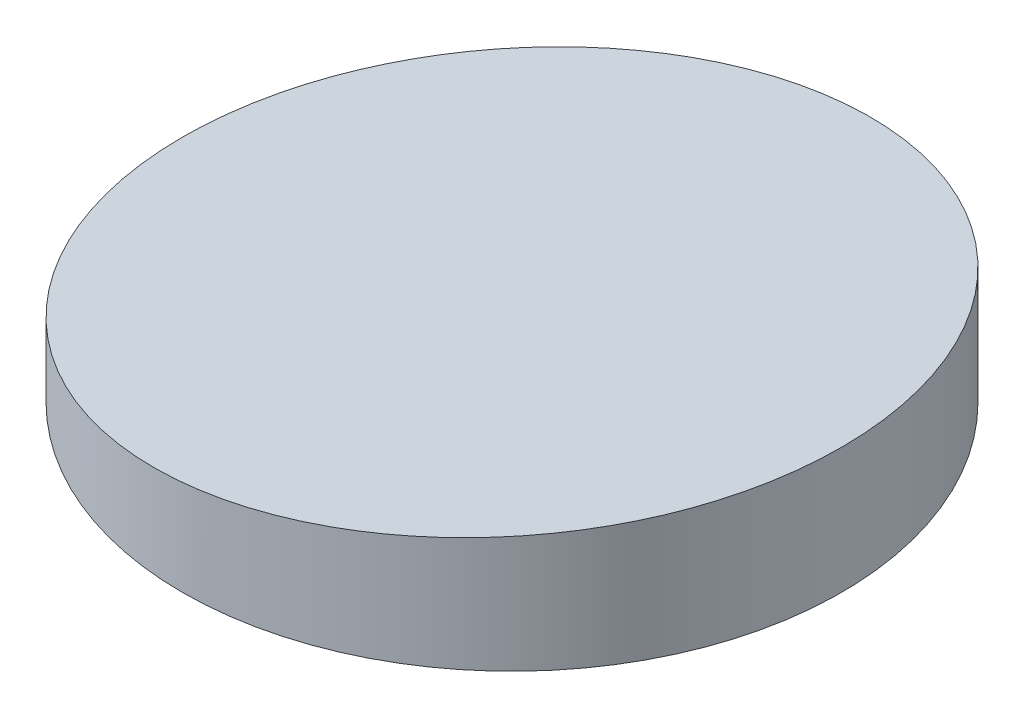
ISO-10303-21;
HEADER;
FILE_DESCRIPTION(('STEP AP214'),'2;1');
FILE_NAME('part.step','',(''),(''),'','','');
FILE_SCHEMA(('AUTOMOTIVE_DESIGN { 1 0 10303 214 1 1 1 1 }'));
ENDSEC;
DATA;
#1=APPLICATION_CONTEXT('core data for automotive mechanical design processes');
#2=APPLICATION_PROTOCOL_DEFINITION('international standard','automotive_design',2000,#1);
#3=PRODUCT_CONTEXT('',#1,'mechanical');
#4=PRODUCT('Part','Part','',(#3));
#5=PRODUCT_RELATED_PRODUCT_CATEGORY('part','',(#4));
#6=PRODUCT_DEFINITION_FORMATION('','',#4);
#7=PRODUCT_DEFINITION_CONTEXT('part definition',#1,'design');
#8=PRODUCT_DEFINITION('design','',#6,#7);
#9=PRODUCT_DEFINITION_SHAPE('','',#8);
#10=(LENGTH_UNIT() NAMED_UNIT(*) SI_UNIT(.MILLI.,.METRE.));
#11=(NAMED_UNIT(*) PLANE_ANGLE_UNIT() SI_UNIT($,.RADIAN.));
#12=(NAMED_UNIT(*) SI_UNIT($,.STERADIAN.) SOLID_ANGLE_UNIT());
#13=UNCERTAINTY_MEASURE_WITH_UNIT(LENGTH_MEASURE(1.E-05),#10,'distance_accuracy_value','');
#14=(GEOMETRIC_REPRESENTATION_CONTEXT(3) GLOBAL_UNCERTAINTY_ASSIGNED_CONTEXT((#13)) GLOBAL_UNIT_ASSIGNED_CONTEXT((#10,
#11,#12)) REPRESENTATION_CONTEXT('',''));
#15=CARTESIAN_POINT('',(0.,0.,0.));
#16=DIRECTION('',(0.,0.,1.));
#17=DIRECTION('',(1.,0.,0.));
#18=AXIS2_PLACEMENT_3D('',#15,#16,#17);
#19=CARTESIAN_POINT('',(0.,25.4,0.));
#20=DIRECTION('',(0.,-1.,0.));
#21=DIRECTION('',(0.,0.,-1.));
#22=AXIS2_PLACEMENT_3D('',#19,#20,#21);
#23=CYLINDRICAL_SURFACE('',#22,50.8);
#24=CARTESIAN_POINT('',(0.,0.,0.));
#25=DIRECTION('',(0.,1.,0.));
#26=DIRECTION('',(0.,0.,1.));
#27=AXIS2_PLACEMENT_3D('',#24,#25,#26);
#28=CIRCLE('',#27,50.8);
#29=CARTESIAN_POINT('',(0.,0.,50.8));
#30=VERTEX_POINT('',#29);
#31=EDGE_CURVE('E38',#30,#30,#28,.T.);
#32=ORIENTED_EDGE('',*,*,#31,.T.);
#33=EDGE_LOOP('',(#32));
#34=FACE_BOUND('',#33,.T.);
#35=CARTESIAN_POINT('',(0.,14.6899904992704,0.));
#36=DIRECTION('',(-0.0919316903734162,0.995765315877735,0.));
#37=DIRECTION('',(-0.995765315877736,-0.0919316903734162,0.));
#38=AXIS2_PLACEMENT_3D('',#35,#36,#37);
#39=ELLIPSE('',#38,51.0160368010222,50.8);
#40=CARTESIAN_POINT('',(-50.8,10.,0.));
#41=VERTEX_POINT('',#40);
#42=EDGE_CURVE('E10',#41,#41,#39,.T.);
#43=ORIENTED_EDGE('',*,*,#42,.F.);
#44=EDGE_LOOP('',(#43));
#45=FACE_BOUND('',#44,.T.);
#46=ADVANCED_FACE('F32',(#34,#45),#23,.T.);
#47=CARTESIAN_POINT('',(0.,0.,0.));
#48=DIRECTION('',(0.,1.,0.));
#49=DIRECTION('',(0.,0.,1.));
#50=AXIS2_PLACEMENT_3D('',#47,#48,#49);
#51=PLANE('',#50);
#52=ORIENTED_EDGE('',*,*,#31,.F.);
#53=EDGE_LOOP('',(#52));
#54=FACE_BOUND('',#53,.T.);
#55=ADVANCED_FACE('F46',(#54),#51,.F.);
#56=CARTESIAN_POINT('',(-50.8,10.,245.889864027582));
#57=DIRECTION('',(-0.0919316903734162,0.995765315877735,0.));
#58=DIRECTION('',(-0.995765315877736,-0.0919316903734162,0.));
#59=AXIS2_PLACEMENT_3D('',#56,#57,#58);
#60=PLANE('',#59);
#61=ORIENTED_EDGE('',*,*,#42,.T.);
#62=EDGE_LOOP('',(#61));
#63=FACE_BOUND('',#62,.T.);
#64=ADVANCED_FACE('F48',(#63),#60,.T.);
#65=CLOSED_SHELL('',(#46,#55,#64));
#66=MANIFOLD_SOLID_BREP('B2',#65);
#67=ADVANCED_BREP_SHAPE_REPRESENTATION('',(#18,#66),#14);
#68=SHAPE_DEFINITION_REPRESENTATION(#9,#67);
ENDSEC;
END-ISO-10303-21;
